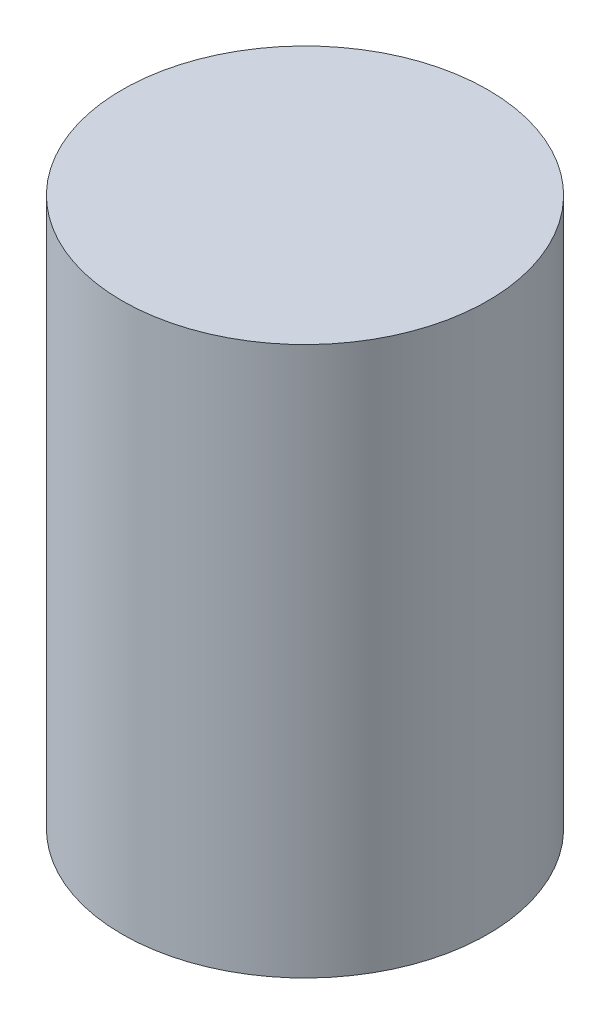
from build123d import *

# Parameters (mm, degrees)
SKETCH_1_W = 20
SKETCH_1_H = 60


with BuildPart() as part:
    # Sketch 1 → Revolve 1 (revolve)
    with BuildSketch(Plane.XY, mode=Mode.PRIVATE) as revolve_1_sk:
        with Locations((-10, 30)):
            Rectangle(SKETCH_1_W, SKETCH_1_H)
    revolve(revolve_1_sk.sketch.rotate(Axis((0, 100.479411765, 0), (0, -1, 0)), 270), axis=Axis((0, 100.479411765, 0), (0, -1, 0)))


solid = part.part
